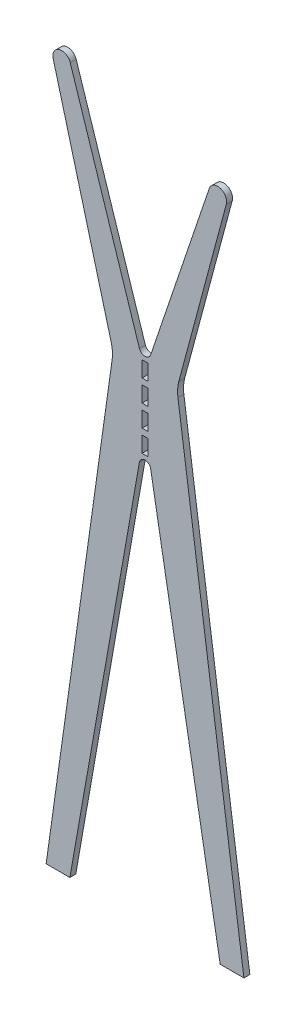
from build123d import *

# Parameters (mm, degrees)
CROQUIS1_W              = 15
CROQUIS1_H              = 40
SALIENTE_EXTRUIR1_DEPTH = 7.5


with BuildPart() as part:
    # Croquis1 → Saliente-Extruir1 (new, symmetric)
    with BuildSketch(Plane.XY):
        with BuildLine():
            Line((-250, -900), (-190, -900))
            Line((-190, -900), (-14.210667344, 96.950846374))
            ThreePointArc((-14.210667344, 96.950846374), (0, 108.875012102), (14.210667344, 96.950846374))
            Line((14.210667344, 96.950846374), (190, -900))
            Line((190, -900), (250, -900))
            Line((250, -900), (83.111353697, 287.474420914))
            ThreePointArc((83.111353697, 287.474420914), (82.403348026, 305.494368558), (85.302155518, 323.293714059))
            Line((85.302155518, 323.293714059), (205.442086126, 771.662039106))
            ThreePointArc((205.442086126, 771.662039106), (190.217326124, 799.035215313), (162.370665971, 784.694796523))
            Line((162.370665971, 784.694796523), (14.210667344, 346.219971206))
            ThreePointArc((14.210667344, 346.219971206), (0, 336.021734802), (-14.210667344, 346.219971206))
            Line((-14.210667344, 346.219971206), (-189.091409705, 884.447552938))
            ThreePointArc((-189.091409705, 884.447552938), (-216.890052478, 899.073126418), (-232.238297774, 871.666862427))
            Line((-232.238297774, 871.666862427), (-85.302155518, 323.293714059))
            ThreePointArc((-85.302155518, 323.293714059), (-82.403348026, 305.494368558), (-83.111353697, 287.474420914))
            Line((-83.111353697, 287.474420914), (-250, -900))
        make_face()
        with Locations((0, 304.948373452)):
            Rectangle(CROQUIS1_W, CROQUIS1_H, mode=Mode.SUBTRACT)
        with Locations((0, 249.948373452)):
            Rectangle(CROQUIS1_W, CROQUIS1_H, mode=Mode.SUBTRACT)
        with Locations((0, 194.948373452)):
            Rectangle(CROQUIS1_W, CROQUIS1_H, mode=Mode.SUBTRACT)
        with Locations((0, 139.948373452)):
            Rectangle(CROQUIS1_W, CROQUIS1_H, mode=Mode.SUBTRACT)
    extrude(amount=SALIENTE_EXTRUIR1_DEPTH, both=True)


solid = part.part
